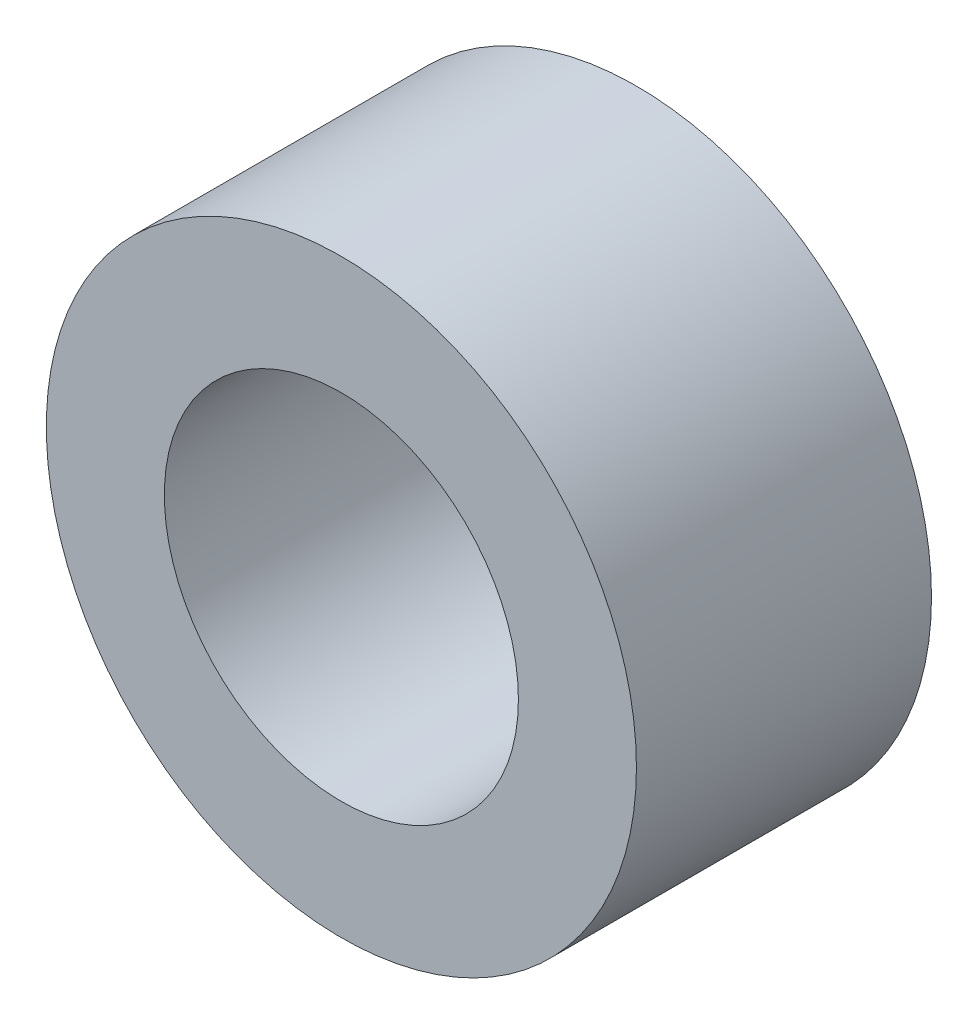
from build123d import *

# Parameters (mm, degrees)
ESQUISSE1_R          = 10
ESQUISSE1_R_2        = 6
BASE_EXTRUSION_DEPTH = 10


with BuildPart() as part:
    # Esquisse1 → Base-Extrusion (new body)
    with BuildSketch(Plane.XY):
        Circle(ESQUISSE1_R)
        Circle(ESQUISSE1_R_2, mode=Mode.SUBTRACT)
    extrude(amount=BASE_EXTRUSION_DEPTH)


solid = part.part
